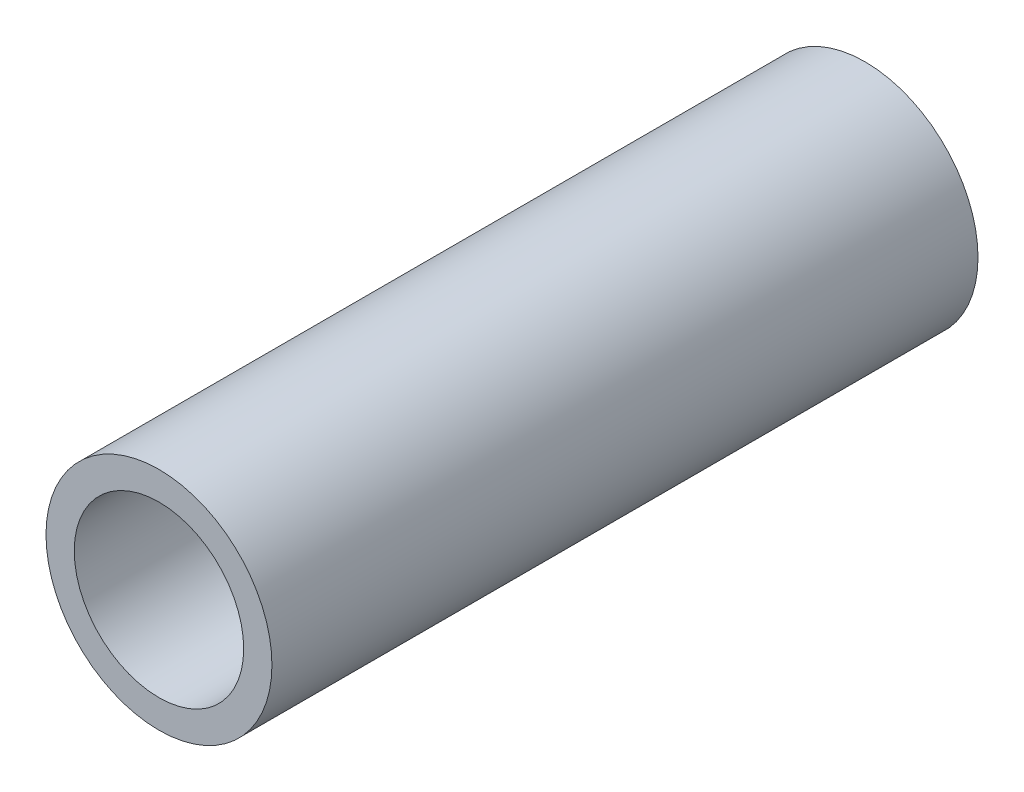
from build123d import *

# Parameters (mm, degrees)
ESQUISSE1_R        = 8
ESQUISSE1_R_2      = 6
BOSS_EXTRU_1_DEPTH = 50


with BuildPart() as part:
    # Esquisse1 → Boss.-Extru.1 (new body)
    with BuildSketch(Plane.XY):
        Circle(ESQUISSE1_R)
        Circle(ESQUISSE1_R_2, mode=Mode.SUBTRACT)
    extrude(amount=BOSS_EXTRU_1_DEPTH)


solid = part.part
